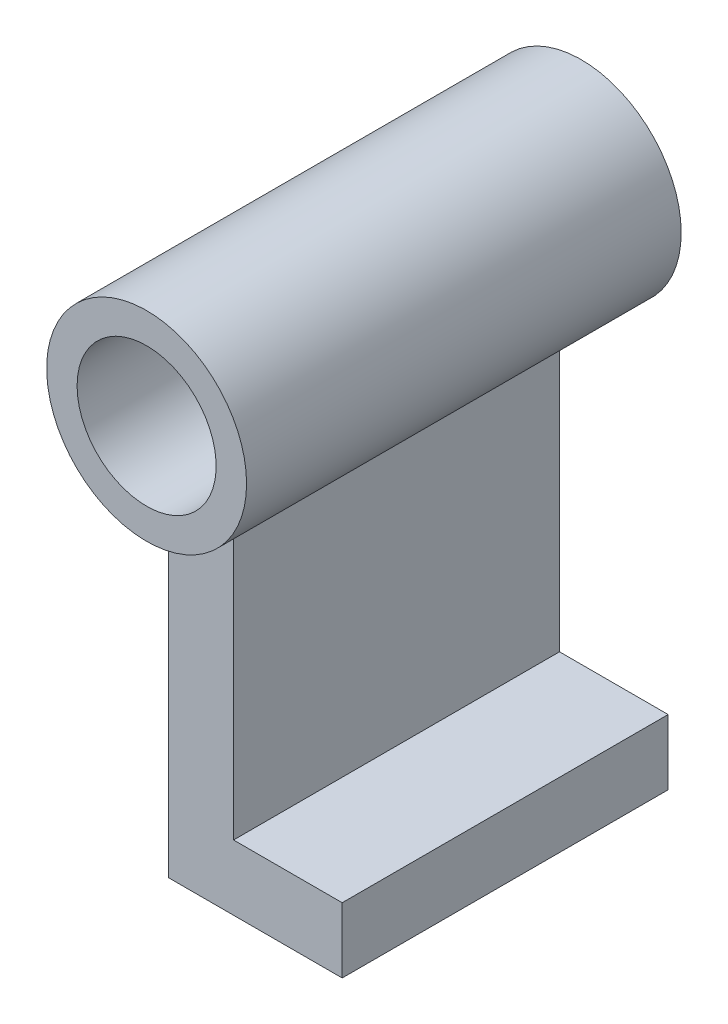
from build123d import *

# Parameters (mm, degrees)
SKETCH1_R           = 23
SKETCH1_R_2         = 16
BOSS_EXTRUDE1_DEPTH = 50
BOSS_EXTRUDE2_DEPTH = 37.5


with BuildPart() as part:
    # Sketch1 → Boss-Extrude1 (new, symmetric)
    with BuildSketch(Plane.XY):
        with Locations(Location((0, 0, 0), (0, 0, 180))):
            Circle(SKETCH1_R)
        with Locations(Location((0, 0, 0), (0, 0, 180))):
            Circle(SKETCH1_R_2, mode=Mode.SUBTRACT)
    extrude(amount=BOSS_EXTRUDE1_DEPTH, both=True)

    # Sketch1_3 → Boss-Extrude2 (add, symmetric)
    with BuildSketch(Plane.XY):
        with BuildLine():
            Line((32.5, -100), (32.5, -85))
            Line((32.5, -85), (7.5, -85))
            Line((7.5, -85), (7.5, -21.742814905))
            ThreePointArc((7.5, -21.742814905), (0, -23), (-7.5, -21.742814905))
            Line((-7.5, -21.742814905), (-7.5, -100))
            Line((-7.5, -100), (32.5, -100))
        make_face()
    extrude(amount=BOSS_EXTRUDE2_DEPTH, both=True)


solid = part.part
